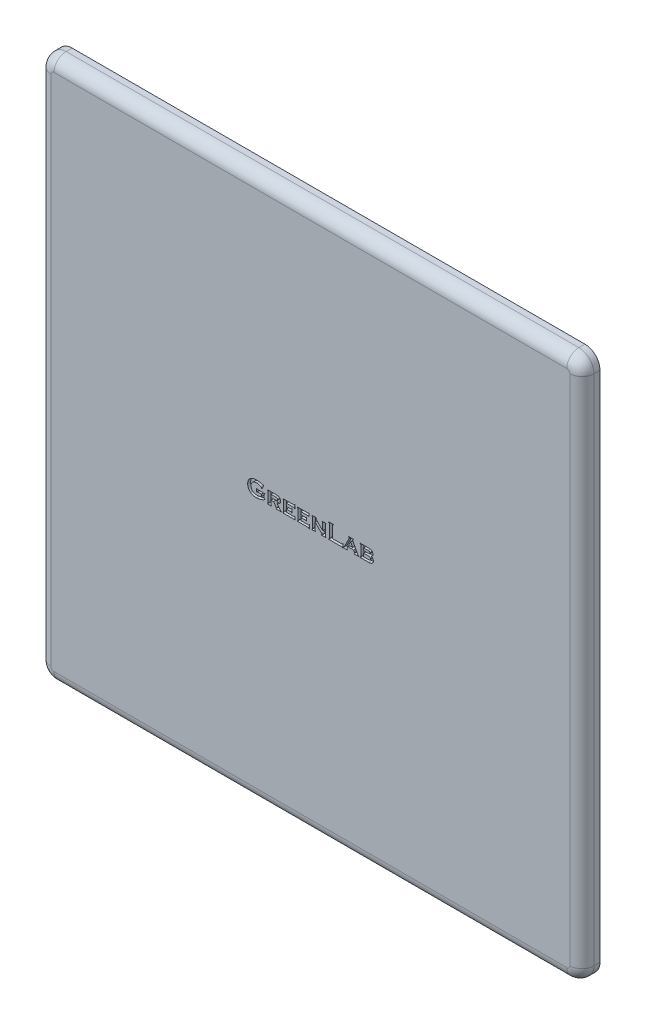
from build123d import *

# Parameters (mm, degrees)
SKETCH1_W           = 90
SKETCH1_H           = 90
BOSS_EXTRUDE1_DEPTH = 3
FILLET1_R           = 2.5
FILLET2_R           = 2
CUT_EXTRUDE1_DEPTH  = 0.5


with BuildPart() as part:
    # Sketch1 → Boss-Extrude1 (new body)
    with BuildSketch(Plane.XY.offset(3)):
        with Locations((-0.036499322, -1.389992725)):
            Rectangle(SKETCH1_W, SKETCH1_H)
    extrude(amount=-BOSS_EXTRUDE1_DEPTH)

    # Fillet1
    fillet1_edges = [part.edges().sort_by_distance(p)[0] for p in [
        (44.963500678, 43.610007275, 1.5),
        (44.963500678, -46.389992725, 1.5),
        (-45.036499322, -46.389992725, 1.5),
        (-45.036499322, 43.610007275, 1.5),
    ]]
    fillet(fillet1_edges, radius=FILLET1_R)

    # Fillet2
    fillet2_edges = [part.edges().sort_by_distance(p)[0] for p in [
        (-45.036499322, -1.389992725, 3),
        (-0.036499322, 43.610007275, 3),
        (-0.036499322, -46.389992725, 3),
        (44.963500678, -1.389992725, 3),
        (44.231267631, 42.877774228, 3),
        (44.231267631, -45.657759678, 3),
        (-44.304266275, 42.877774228, 3),
        (-44.304266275, -45.657759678, 3),
    ]]
    fillet(fillet2_edges, radius=FILLET2_R)

    # Sketch2 → Cut-Extrude1 (cut)
    # profile 1 of 8: a face of its own
    with BuildSketch(Plane.XY.offset(3)):
        with BuildLine():
            Line((-8.144138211, -1.737214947), (-8.773478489, -1.737214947))
            add(Edge.make_bspline(
                [(-8.773478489, -1.737214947), (-8.782519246, -1.737627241), (-8.799601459, -1.738406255), (-8.8238465, -1.741488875), (-8.843990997, -1.749456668), (-8.861458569, -1.759285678), (-8.875389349, -1.773931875), (-8.88796918, -1.792222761), (-8.899277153, -1.815063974), (-8.904992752, -1.832255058), (-8.9080271, -1.841381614)],
                knots=[0, 0, 0, 0, 1.161951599, 2.195469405, 3.113157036, 3.92473158, 4.744880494, 5.677977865, 6.767264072, 8, 8, 8, 8], degree=3))
            Line((-8.9080271, -1.841381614), (-8.977471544, -1.841381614))
            Line((-8.977471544, -1.841381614), (-8.977471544, -1.285826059))
            Line((-8.977471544, -1.285826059), (-8.9080271, -1.285826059))
            add(Edge.make_bspline(
                [(-8.9080271, -1.285826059), (-8.905044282, -1.295160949), (-8.899471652, -1.312600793), (-8.887670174, -1.335390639), (-8.876148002, -1.354438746), (-8.862165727, -1.368844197), (-8.84506833, -1.378330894), (-8.82537208, -1.385574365), (-8.801790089, -1.388851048), (-8.785056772, -1.389597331), (-8.776191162, -1.389992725)],
                knots=[0, 0, 0, 0, 1.267174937, 2.367390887, 3.316236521, 4.144614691, 4.932227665, 5.829021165, 6.8497767, 8, 8, 8, 8], degree=3))
            Line((-8.776191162, -1.389992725), (-7.588582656, -1.389992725))
            Line((-7.588582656, -1.389992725), (-7.588582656, -1.45943717))
            add(Edge.make_bspline(
                [(-7.588582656, -1.45943717), (-7.59754101, -1.462269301), (-7.614378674, -1.46759243), (-7.636756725, -1.478760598), (-7.655461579, -1.490214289), (-7.669798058, -1.503939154), (-7.680692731, -1.519693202), (-7.687410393, -1.538585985), (-7.691916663, -1.560317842), (-7.692458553, -1.575873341), (-7.692749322, -1.584220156)],
                knots=[0, 0, 0, 0, 1.261989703, 2.371971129, 3.357346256, 4.200586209, 5.023932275, 5.909634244, 6.878345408, 8, 8, 8, 8], degree=3))
            Line((-7.692749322, -1.584220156), (-7.692749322, -2.06382085))
            add(Edge.make_bspline(
                [(-7.692749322, -2.06382085), (-7.692389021, -2.072153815), (-7.691719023, -2.087649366), (-7.688043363, -2.109684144), (-7.681231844, -2.128574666), (-7.670937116, -2.144781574), (-7.656643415, -2.158383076), (-7.6375534, -2.16930767), (-7.614917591, -2.180464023), (-7.597724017, -2.185778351), (-7.588582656, -2.188603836)],
                knots=[0, 0, 0, 0, 1.116533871, 2.076248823, 2.980572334, 3.786808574, 4.626198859, 5.59413096, 6.720864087, 8, 8, 8, 8], degree=3))
            Line((-7.588582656, -2.188603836), (-7.588582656, -2.258048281))
            add(Edge.make_bspline(
                [(-7.588582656, -2.258048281), (-7.647165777, -2.291299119), (-7.762319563, -2.356658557), (-7.938587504, -2.441141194), (-8.113332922, -2.513076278), (-8.286717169, -2.571925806), (-8.458679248, -2.617915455), (-8.629290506, -2.650401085), (-8.798656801, -2.670905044), (-8.911226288, -2.67345022), (-8.967163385, -2.674714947)],
                knots=[0, 0, 0, 0, 1.109239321, 2.180373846, 3.216973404, 4.220153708, 5.194106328, 6.146335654, 7.078892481, 8, 8, 8, 8], degree=3))
            add(Edge.make_bspline(
                [(-8.967163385, -2.674714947), (-9.016570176, -2.673985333), (-9.113047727, -2.6725606), (-9.254211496, -2.658411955), (-9.388532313, -2.636773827), (-9.515697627, -2.60491896), (-9.636576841, -2.565743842), (-9.749879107, -2.516101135), (-9.856763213, -2.458190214), (-9.922429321, -2.412224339), (-9.955119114, -2.389341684)],
                knots=[0, 0, 0, 0, 1.133031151, 2.212490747, 3.251195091, 4.25132316, 5.216867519, 6.162529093, 7.085273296, 8, 8, 8, 8], degree=3))
            add(Edge.make_bspline(
                [(-9.955119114, -2.389341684), (-9.974623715, -2.374161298), (-10.013342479, -2.344026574), (-10.06812678, -2.295921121), (-10.118661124, -2.245018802), (-10.166049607, -2.192711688), (-10.209092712, -2.137394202), (-10.248472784, -2.080087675), (-10.284671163, -2.020933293), (-10.315923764, -1.959172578), (-10.344477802, -1.895617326), (-10.368677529, -1.829551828), (-10.389228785, -1.761381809), (-10.406973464, -1.691264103), (-10.419684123, -1.618685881), (-10.428759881, -1.543883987), (-10.435179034, -1.467144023), (-10.435595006, -1.415143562), (-10.435804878, -1.388907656)],
                knots=[0, 0, 0, 0, 1.027594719, 2.039887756, 3.02889878, 4.008719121, 4.97294883, 5.940778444, 6.898978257, 7.854104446, 8.816896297, 9.794723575, 10.777166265, 11.776613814, 12.800294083, 13.838400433, 14.909403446, 16, 16, 16, 16], degree=3))
            add(Edge.make_bspline(
                [(-10.435804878, -1.388907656), (-10.434663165, -1.340368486), (-10.432433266, -1.245565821), (-10.411811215, -1.107139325), (-10.378221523, -0.976379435), (-10.331689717, -0.852851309), (-10.270624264, -0.737522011), (-10.197173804, -0.629462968), (-10.109694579, -0.529049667), (-10.042460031, -0.47001784), (-10.008287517, -0.440014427)],
                knots=[0, 0, 0, 0, 1.080618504, 2.110574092, 3.109061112, 4.08310081, 5.043468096, 6.008781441, 6.987946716, 8, 8, 8, 8], degree=3))
            add(Edge.make_bspline(
                [(-10.008287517, -0.440014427), (-9.973768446, -0.412982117), (-9.904418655, -0.358673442), (-9.789285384, -0.291422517), (-9.666635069, -0.233476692), (-9.535458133, -0.186305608), (-9.395926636, -0.150143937), (-9.248251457, -0.124304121), (-9.092297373, -0.108324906), (-8.985467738, -0.106304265), (-8.930813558, -0.105270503)],
                knots=[0, 0, 0, 0, 0.913103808, 1.834451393, 2.772129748, 3.738097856, 4.735733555, 5.773315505, 6.860825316, 8, 8, 8, 8], degree=3))
            add(Edge.make_bspline(
                [(-8.930813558, -0.105270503), (-8.895720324, -0.105879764), (-8.82654932, -0.107080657), (-8.724365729, -0.113944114), (-8.625337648, -0.126594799), (-8.527504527, -0.144157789), (-8.428003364, -0.168094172), (-8.323395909, -0.198183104), (-8.212481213, -0.235024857), (-8.136984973, -0.263594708), (-8.09802276, -0.278339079)],
                knots=[0, 0, 0, 0, 0.983904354, 1.939338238, 2.869415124, 3.781350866, 4.72455948, 5.737149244, 6.832184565, 8, 8, 8, 8], degree=3))
            add(Edge.make_bspline(
                [(-8.09802276, -0.278339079), (-8.078921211, -0.285769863), (-8.043877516, -0.299402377), (-7.995262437, -0.315244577), (-7.955382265, -0.325505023), (-7.931503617, -0.327421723), (-7.92115644, -0.328252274)],
                knots=[0, 0, 0, 0, 1.33242011, 2.444457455, 3.325947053, 4, 4, 4, 4], degree=3))
            add(Edge.make_bspline(
                [(-7.92115644, -0.328252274), (-7.914395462, -0.327662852), (-7.899898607, -0.326399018), (-7.87818472, -0.317405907), (-7.854893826, -0.304059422), (-7.83981049, -0.292303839), (-7.831638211, -0.285934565)],
                knots=[0, 0, 0, 0, 0.80452628, 1.72506123, 2.767418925, 4, 4, 4, 4], degree=3))
            Line((-7.831638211, -0.285934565), (-7.762193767, -0.313603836))
            Line((-7.762193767, -0.313603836), (-8.057332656, -0.91256217))
            Line((-8.057332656, -0.91256217), (-8.110501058, -0.884350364))
            add(Edge.make_bspline(
                [(-8.110501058, -0.884350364), (-8.110802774, -0.874742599), (-8.111357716, -0.857071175), (-8.115526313, -0.832832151), (-8.119983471, -0.812699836), (-8.126666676, -0.795494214), (-8.137850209, -0.780525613), (-8.151749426, -0.764139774), (-8.171163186, -0.747063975), (-8.185682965, -0.735446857), (-8.193508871, -0.729185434)],
                knots=[0, 0, 0, 0, 1.244331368, 2.288680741, 3.181265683, 3.916936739, 4.658188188, 5.588746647, 6.700376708, 8, 8, 8, 8], degree=3))
            add(Edge.make_bspline(
                [(-8.193508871, -0.729185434), (-8.214203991, -0.714980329), (-8.258191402, -0.684787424), (-8.33472517, -0.646463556), (-8.42449474, -0.612615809), (-8.524113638, -0.581379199), (-8.628624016, -0.555285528), (-8.732988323, -0.536236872), (-8.834504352, -0.524251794), (-8.901305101, -0.522698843), (-8.934068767, -0.52193717)],
                knots=[0, 0, 0, 0, 0.772448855, 1.64183753, 2.627606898, 3.725128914, 4.855858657, 5.942928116, 6.991070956, 8, 8, 8, 8], degree=3))
            add(Edge.make_bspline(
                [(-8.934068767, -0.52193717), (-8.966288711, -0.522485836), (-9.02927475, -0.523558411), (-9.121811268, -0.534226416), (-9.209999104, -0.551399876), (-9.294297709, -0.575331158), (-9.374073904, -0.606156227), (-9.449643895, -0.644183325), (-9.52163994, -0.688074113), (-9.565399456, -0.723438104), (-9.587280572, -0.741121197)],
                knots=[0, 0, 0, 0, 1.098368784, 2.14717621, 3.171603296, 4.15934231, 5.131674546, 6.083189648, 7.041535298, 8, 8, 8, 8], degree=3))
            add(Edge.make_bspline(
                [(-9.587280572, -0.741121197), (-9.610785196, -0.762104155), (-9.656995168, -0.803356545), (-9.716418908, -0.873937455), (-9.767059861, -0.948834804), (-9.808821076, -1.028825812), (-9.840901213, -1.113932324), (-9.863375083, -1.204070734), (-9.878199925, -1.298899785), (-9.879557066, -1.363893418), (-9.880249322, -1.397045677)],
                knots=[0, 0, 0, 0, 1.016795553, 1.999014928, 2.971244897, 3.932867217, 4.907271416, 5.901990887, 6.92983762, 8, 8, 8, 8], degree=3))
            add(Edge.make_bspline(
                [(-9.880249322, -1.397045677), (-9.879526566, -1.429292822), (-9.878114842, -1.492279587), (-9.8637868, -1.584374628), (-9.842161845, -1.671923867), (-9.810061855, -1.754527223), (-9.770107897, -1.832500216), (-9.720282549, -1.905292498), (-9.662631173, -1.974294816), (-9.617302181, -2.014628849), (-9.594333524, -2.03506651)],
                knots=[0, 0, 0, 0, 1.069643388, 2.089281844, 3.086639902, 4.057689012, 5.02427436, 5.988321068, 6.980662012, 8, 8, 8, 8], degree=3))
            add(Edge.make_bspline(
                [(-9.594333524, -2.03506651), (-9.572064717, -2.052887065), (-9.527330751, -2.088685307), (-9.453696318, -2.134298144), (-9.374500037, -2.172090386), (-9.290715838, -2.203752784), (-9.201718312, -2.228238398), (-9.107465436, -2.245179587), (-9.008132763, -2.256588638), (-8.940069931, -2.25755488), (-8.905314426, -2.258048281)],
                knots=[0, 0, 0, 0, 0.924808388, 1.857771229, 2.80254234, 3.768129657, 4.760342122, 5.792672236, 6.872853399, 8, 8, 8, 8], degree=3))
            add(Edge.make_bspline(
                [(-8.905314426, -2.258048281), (-8.870758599, -2.257321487), (-8.801723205, -2.255869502), (-8.69839727, -2.247254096), (-8.595968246, -2.231744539), (-8.495010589, -2.211466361), (-8.397901, -2.185725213), (-8.306399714, -2.155560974), (-8.222048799, -2.120496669), (-8.16963508, -2.092953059), (-8.144138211, -2.079554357)],
                knots=[0, 0, 0, 0, 1.05048524, 2.098652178, 3.148964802, 4.19795309, 5.227341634, 6.200829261, 7.124785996, 8, 8, 8, 8], degree=3))
            Line((-8.144138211, -2.079554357), (-8.144138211, -1.737214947))
        make_face()
    # profile 2 of 8: a face of its own
    with BuildSketch(Plane.XY.offset(3)):
        with BuildLine():
            Line((-6.581638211, -1.806659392), (-6.581638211, -2.438169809))
            add(Edge.make_bspline(
                [(-6.581638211, -2.438169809), (-6.581339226, -2.446872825), (-6.580780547, -2.463135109), (-6.576346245, -2.485988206), (-6.569437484, -2.505677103), (-6.559532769, -2.522890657), (-6.544724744, -2.536970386), (-6.526446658, -2.549739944), (-6.503579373, -2.561308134), (-6.486596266, -2.567318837), (-6.477471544, -2.570548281)],
                knots=[0, 0, 0, 0, 1.132768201, 2.116668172, 3.018181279, 3.842213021, 4.674950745, 5.655178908, 6.740169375, 8, 8, 8, 8], degree=3))
            Line((-6.477471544, -2.570548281), (-6.477471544, -2.639992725))
            Line((-6.477471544, -2.639992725), (-7.171915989, -2.639992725))
            Line((-7.171915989, -2.639992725), (-7.171915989, -2.570548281))
            add(Edge.make_bspline(
                [(-7.171915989, -2.570548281), (-7.16297178, -2.56769371), (-7.146160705, -2.562328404), (-7.123652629, -2.551458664), (-7.105319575, -2.539027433), (-7.090978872, -2.524313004), (-7.080495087, -2.506813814), (-7.072915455, -2.486618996), (-7.068653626, -2.463118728), (-7.06806431, -2.446506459), (-7.067749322, -2.437627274)],
                knots=[0, 0, 0, 0, 1.214843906, 2.283358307, 3.225537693, 4.070394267, 4.922042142, 5.848661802, 6.850119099, 8, 8, 8, 8], degree=3))
            Line((-7.067749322, -2.437627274), (-7.067749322, -0.793747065))
            add(Edge.make_bspline(
                [(-7.067749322, -0.793747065), (-7.068180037, -0.785073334), (-7.069000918, -0.768542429), (-7.071879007, -0.745108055), (-7.080264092, -0.725699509), (-7.089773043, -0.708439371), (-7.104635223, -0.694599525), (-7.122542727, -0.681296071), (-7.145730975, -0.670251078), (-7.162817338, -0.664101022), (-7.171915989, -0.660826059)],
                knots=[0, 0, 0, 0, 1.128472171, 2.1507081, 3.035212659, 3.856119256, 4.685698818, 5.643135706, 6.74494729, 8, 8, 8, 8], degree=3))
            Line((-7.171915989, -0.660826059), (-7.171915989, -0.591381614))
            Line((-7.171915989, -0.591381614), (-5.84162085, -0.591381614))
            add(Edge.make_bspline(
                [(-5.84162085, -0.591381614), (-5.800927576, -0.59167351), (-5.724751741, -0.592219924), (-5.618103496, -0.596675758), (-5.527062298, -0.605329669), (-5.449154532, -0.616362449), (-5.380713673, -0.632585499), (-5.317790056, -0.653592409), (-5.258430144, -0.680220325), (-5.221837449, -0.702398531), (-5.203600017, -0.713451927)],
                knots=[0, 0, 0, 0, 1.48188809, 2.77402262, 3.885406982, 4.811191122, 5.637019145, 6.442966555, 7.223990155, 8, 8, 8, 8], degree=3))
            add(Edge.make_bspline(
                [(-5.203600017, -0.713451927), (-5.186012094, -0.725787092), (-5.151226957, -0.750183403), (-5.10641443, -0.795472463), (-5.068809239, -0.846466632), (-5.037558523, -0.902736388), (-5.013717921, -0.96488959), (-4.996390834, -1.032577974), (-4.986026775, -1.106107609), (-4.984963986, -1.157030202), (-4.984415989, -1.183286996)],
                knots=[0, 0, 0, 0, 0.949876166, 1.878651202, 2.806113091, 3.748939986, 4.72015234, 5.745812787, 6.837692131, 8, 8, 8, 8], degree=3))
            add(Edge.make_bspline(
                [(-4.984415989, -1.183286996), (-4.984814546, -1.203377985), (-4.985592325, -1.242585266), (-4.992172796, -1.299773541), (-5.003067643, -1.353432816), (-5.017406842, -1.404013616), (-5.03733505, -1.450649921), (-5.060483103, -1.494669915), (-5.088890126, -1.534657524), (-5.121332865, -1.571698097), (-5.158733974, -1.605338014), (-5.200702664, -1.637279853), (-5.248517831, -1.665485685), (-5.30121253, -1.691922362), (-5.359222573, -1.715383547), (-5.422322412, -1.737283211), (-5.490898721, -1.756130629), (-5.538653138, -1.766556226), (-5.563300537, -1.77193717)],
                knots=[0, 0, 0, 0, 1.054974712, 2.05876829, 3.018077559, 3.928757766, 4.81427522, 5.67693176, 6.535972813, 7.383915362, 8.257948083, 9.17356801, 10.149288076, 11.168732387, 12.267602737, 13.433048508, 14.67512408, 16, 16, 16, 16], degree=3))
            Line((-5.563300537, -1.77193717), (-5.166165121, -2.30741894))
            add(Edge.make_bspline(
                [(-5.166165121, -2.30741894), (-5.149198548, -2.329833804), (-5.11782083, -2.371287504), (-5.071522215, -2.426039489), (-5.031652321, -2.470205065), (-4.995313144, -2.503674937), (-4.960310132, -2.52904479), (-4.923735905, -2.547172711), (-4.885890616, -2.562652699), (-4.859035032, -2.567905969), (-4.8455271, -2.570548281)],
                knots=[0, 0, 0, 0, 1.583031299, 2.927633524, 4.037651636, 4.931799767, 5.706188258, 6.462410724, 7.226616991, 8, 8, 8, 8], degree=3))
            Line((-4.8455271, -2.570548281), (-4.8455271, -2.639992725))
            Line((-4.8455271, -2.639992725), (-5.770548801, -2.639992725))
            Line((-5.770548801, -2.639992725), (-5.770548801, -2.570548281))
            add(Edge.make_bspline(
                [(-5.770548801, -2.570548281), (-5.755764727, -2.566538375), (-5.729315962, -2.559364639), (-5.697754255, -2.540734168), (-5.674652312, -2.518840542), (-5.672362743, -2.500251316), (-5.671264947, -2.491338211)],
                knots=[0, 0, 0, 0, 1.339679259, 2.396691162, 3.231250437, 4, 4, 4, 4], degree=3))
            add(Edge.make_bspline(
                [(-5.671264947, -2.491338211), (-5.672163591, -2.483821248), (-5.674242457, -2.466431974), (-5.687946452, -2.439374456), (-5.707438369, -2.40713322), (-5.724686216, -2.385175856), (-5.734198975, -2.373065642)],
                knots=[0, 0, 0, 0, 0.664601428, 1.537447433, 2.641820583, 4, 4, 4, 4], degree=3))
            Line((-5.734198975, -2.373065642), (-6.142727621, -1.806659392))
            Line((-6.142727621, -1.806659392), (-6.581638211, -1.806659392))
        make_face()
        with BuildLine():
            Line((-6.581638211, -1.424714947), (-5.836195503, -1.424714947))
            add(Edge.make_bspline(
                [(-5.836195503, -1.424714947), (-5.809759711, -1.424463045), (-5.760396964, -1.423992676), (-5.691983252, -1.416453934), (-5.633783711, -1.407233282), (-5.60024108, -1.394632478), (-5.585001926, -1.388907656)],
                knots=[0, 0, 0, 0, 1.241949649, 2.3190547, 3.236309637, 4, 4, 4, 4], degree=3))
            add(Edge.make_bspline(
                [(-5.585001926, -1.388907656), (-5.575990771, -1.384646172), (-5.558390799, -1.376322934), (-5.534973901, -1.359674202), (-5.514097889, -1.340840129), (-5.498799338, -1.317462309), (-5.48586407, -1.292094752), (-5.476771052, -1.263732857), (-5.471219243, -1.232333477), (-5.470764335, -1.210438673), (-5.4705271, -1.199020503)],
                knots=[0, 0, 0, 0, 1.008207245, 1.969161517, 2.902631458, 3.838078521, 4.780680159, 5.783374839, 6.844026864, 8, 8, 8, 8], degree=3))
            add(Edge.make_bspline(
                [(-5.4705271, -1.199020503), (-5.471249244, -1.179364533), (-5.472599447, -1.142613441), (-5.488019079, -1.092225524), (-5.51343648, -1.050902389), (-5.544497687, -1.026014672), (-5.573435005, -1.010456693), (-5.599665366, -1.000826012), (-5.629359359, -0.992160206), (-5.663292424, -0.985201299), (-5.700989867, -0.979906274), (-5.742651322, -0.97634143), (-5.788047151, -0.973289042), (-5.819732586, -0.973313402), (-5.836195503, -0.973326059)],
                knots=[0, 0, 0, 0, 1.425592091, 2.665453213, 3.789359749, 4.900959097, 5.513024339, 6.175067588, 6.928547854, 7.761851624, 8.692003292, 9.695964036, 10.802883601, 12, 12, 12, 12], degree=3))
            Line((-5.836195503, -0.973326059), (-6.581638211, -0.973326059))
            Line((-6.581638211, -0.973326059), (-6.581638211, -1.424714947))
        make_face(mode=Mode.SUBTRACT)
    # profile 3 of 8: a face of its own
    with BuildSketch(Plane.XY.offset(3)):
        with BuildLine():
            Line((-4.012193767, -1.806659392), (-4.012193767, -2.258048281))
            Line((-4.012193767, -2.258048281), (-2.754055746, -2.258048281))
            add(Edge.make_bspline(
                [(-2.754055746, -2.258048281), (-2.745362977, -2.257680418), (-2.729152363, -2.256994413), (-2.706205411, -2.253415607), (-2.686602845, -2.24654378), (-2.669818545, -2.236122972), (-2.655200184, -2.222052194), (-2.64294848, -2.203182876), (-2.632154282, -2.180078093), (-2.626382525, -2.162992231), (-2.623304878, -2.153881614)],
                knots=[0, 0, 0, 0, 1.135380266, 2.11730133, 3.020893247, 3.826673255, 4.678188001, 5.647254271, 6.745456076, 8, 8, 8, 8], degree=3))
            Line((-2.623304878, -2.153881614), (-2.553860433, -2.153881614))
            Line((-2.553860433, -2.153881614), (-2.553860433, -2.744159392))
            Line((-2.553860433, -2.744159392), (-2.623304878, -2.744159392))
            add(Edge.make_bspline(
                [(-2.623304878, -2.744159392), (-2.625934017, -2.735199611), (-2.630889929, -2.71831048), (-2.641882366, -2.695912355), (-2.654262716, -2.677537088), (-2.668936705, -2.663409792), (-2.686032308, -2.652577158), (-2.706169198, -2.645190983), (-2.729464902, -2.64092119), (-2.74589859, -2.640314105), (-2.754598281, -2.639992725)],
                knots=[0, 0, 0, 0, 1.215074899, 2.290408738, 3.23860127, 4.08884986, 4.925925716, 5.858459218, 6.866307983, 8, 8, 8, 8], degree=3))
            Line((-2.754598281, -2.639992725), (-4.602471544, -2.639992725))
            Line((-4.602471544, -2.639992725), (-4.602471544, -2.570548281))
            add(Edge.make_bspline(
                [(-4.602471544, -2.570548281), (-4.593527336, -2.56769371), (-4.576716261, -2.562328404), (-4.554208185, -2.551458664), (-4.53587513, -2.539027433), (-4.521534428, -2.524313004), (-4.511050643, -2.506813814), (-4.50347101, -2.486618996), (-4.499209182, -2.463118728), (-4.498619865, -2.446506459), (-4.498304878, -2.437627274)],
                knots=[0, 0, 0, 0, 1.214843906, 2.283358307, 3.225537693, 4.070394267, 4.922042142, 5.848661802, 6.850119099, 8, 8, 8, 8], degree=3))
            Line((-4.498304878, -2.437627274), (-4.498304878, -0.793747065))
            add(Edge.make_bspline(
                [(-4.498304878, -0.793747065), (-4.498735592, -0.785073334), (-4.499556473, -0.768542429), (-4.502434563, -0.745108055), (-4.510819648, -0.725699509), (-4.520328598, -0.708439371), (-4.535190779, -0.694599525), (-4.553098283, -0.681296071), (-4.57628653, -0.670251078), (-4.593372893, -0.664101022), (-4.602471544, -0.660826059)],
                knots=[0, 0, 0, 0, 1.128472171, 2.1507081, 3.035212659, 3.856119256, 4.685698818, 5.643135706, 6.74494729, 8, 8, 8, 8], degree=3))
            Line((-4.602471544, -0.660826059), (-4.602471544, -0.591381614))
            Line((-4.602471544, -0.591381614), (-2.82458526, -0.591381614))
            add(Edge.make_bspline(
                [(-2.82458526, -0.591381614), (-2.8157025, -0.591076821), (-2.799083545, -0.590506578), (-2.775856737, -0.586161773), (-2.755957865, -0.57921028), (-2.738789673, -0.569092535), (-2.724097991, -0.554828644), (-2.712020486, -0.536080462), (-2.70082796, -0.513391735), (-2.695570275, -0.496355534), (-2.692749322, -0.487214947)],
                knots=[0, 0, 0, 0, 1.152879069, 2.156947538, 3.05581166, 3.877422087, 4.724481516, 5.688477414, 6.75977783, 8, 8, 8, 8], degree=3))
            Line((-2.692749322, -0.487214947), (-2.623304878, -0.487214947))
            Line((-2.623304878, -0.487214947), (-2.623304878, -1.077492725))
            Line((-2.623304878, -1.077492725), (-2.692749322, -1.077492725))
            add(Edge.make_bspline(
                [(-2.692749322, -1.077492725), (-2.695614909, -1.068376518), (-2.701004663, -1.051230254), (-2.711690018, -1.028243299), (-2.724298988, -1.00985038), (-2.73874536, -0.995534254), (-2.755959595, -0.985806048), (-2.775415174, -0.977466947), (-2.798834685, -0.974574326), (-2.815367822, -0.973755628), (-2.824042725, -0.973326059)],
                knots=[0, 0, 0, 0, 1.242738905, 2.33741155, 3.283964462, 4.132742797, 4.956020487, 5.843079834, 6.86826837, 8, 8, 8, 8], degree=3))
            Line((-2.824042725, -0.973326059), (-4.012193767, -0.973326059))
            Line((-4.012193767, -0.973326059), (-4.012193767, -1.424714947))
            Line((-4.012193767, -1.424714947), (-3.274889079, -1.424714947))
            add(Edge.make_bspline(
                [(-3.274889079, -1.424714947), (-3.266367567, -1.424401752), (-3.25028759, -1.423810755), (-3.22778269, -1.419492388), (-3.208382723, -1.412570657), (-3.191743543, -1.402244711), (-3.177080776, -1.388195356), (-3.16508643, -1.369287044), (-3.153320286, -1.346701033), (-3.147347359, -1.329688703), (-3.144138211, -1.320548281)],
                knots=[0, 0, 0, 0, 1.117968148, 2.109590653, 2.995889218, 3.806125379, 4.662349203, 5.636774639, 6.730281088, 8, 8, 8, 8], degree=3))
            Line((-3.144138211, -1.320548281), (-3.074693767, -1.320548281))
            Line((-3.074693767, -1.320548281), (-3.074693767, -1.910826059))
            Line((-3.074693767, -1.910826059), (-3.144138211, -1.910826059))
            add(Edge.make_bspline(
                [(-3.144138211, -1.910826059), (-3.146983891, -1.901876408), (-3.152332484, -1.885055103), (-3.163377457, -1.862479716), (-3.17549579, -1.843930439), (-3.189802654, -1.829387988), (-3.206523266, -1.818887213), (-3.226482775, -1.811720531), (-3.249585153, -1.807635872), (-3.266191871, -1.806995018), (-3.274889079, -1.806659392)],
                knots=[0, 0, 0, 0, 1.225527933, 2.303439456, 3.273384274, 4.108798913, 4.947881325, 5.830104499, 6.863590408, 8, 8, 8, 8], degree=3))
            Line((-3.274889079, -1.806659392), (-4.012193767, -1.806659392))
        make_face()
    # profile 4 of 8: a face of its own
    with BuildSketch(Plane.XY.offset(3)):
        with BuildLine():
            Line((-1.616360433, -1.806659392), (-1.616360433, -2.258048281))
            Line((-1.616360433, -2.258048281), (-0.358222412, -2.258048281))
            add(Edge.make_bspline(
                [(-0.358222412, -2.258048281), (-0.349529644, -2.257680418), (-0.33331903, -2.256994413), (-0.310372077, -2.253415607), (-0.290769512, -2.24654378), (-0.273985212, -2.236122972), (-0.259366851, -2.222052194), (-0.247115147, -2.203182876), (-0.236320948, -2.180078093), (-0.230549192, -2.162992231), (-0.227471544, -2.153881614)],
                knots=[0, 0, 0, 0, 1.135380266, 2.11730133, 3.020893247, 3.826673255, 4.678188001, 5.647254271, 6.745456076, 8, 8, 8, 8], degree=3))
            Line((-0.227471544, -2.153881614), (-0.1580271, -2.153881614))
            Line((-0.1580271, -2.153881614), (-0.1580271, -2.744159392))
            Line((-0.1580271, -2.744159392), (-0.227471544, -2.744159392))
            add(Edge.make_bspline(
                [(-0.227471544, -2.744159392), (-0.230100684, -2.735199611), (-0.235056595, -2.71831048), (-0.246049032, -2.695912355), (-0.258429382, -2.677537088), (-0.273103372, -2.663409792), (-0.290198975, -2.652577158), (-0.310335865, -2.645190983), (-0.333631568, -2.64092119), (-0.350065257, -2.640314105), (-0.358764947, -2.639992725)],
                knots=[0, 0, 0, 0, 1.215074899, 2.290408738, 3.23860127, 4.08884986, 4.925925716, 5.858459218, 6.866307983, 8, 8, 8, 8], degree=3))
            Line((-0.358764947, -2.639992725), (-2.206638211, -2.639992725))
            Line((-2.206638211, -2.639992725), (-2.206638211, -2.570548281))
            add(Edge.make_bspline(
                [(-2.206638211, -2.570548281), (-2.197694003, -2.56769371), (-2.180882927, -2.562328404), (-2.158374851, -2.551458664), (-2.140041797, -2.539027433), (-2.125701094, -2.524313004), (-2.115217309, -2.506813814), (-2.107637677, -2.486618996), (-2.103375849, -2.463118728), (-2.102786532, -2.446506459), (-2.102471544, -2.437627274)],
                knots=[0, 0, 0, 0, 1.214843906, 2.283358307, 3.225537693, 4.070394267, 4.922042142, 5.848661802, 6.850119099, 8, 8, 8, 8], degree=3))
            Line((-2.102471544, -2.437627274), (-2.102471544, -0.793747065))
            add(Edge.make_bspline(
                [(-2.102471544, -0.793747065), (-2.102902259, -0.785073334), (-2.10372314, -0.768542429), (-2.106601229, -0.745108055), (-2.114986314, -0.725699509), (-2.124495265, -0.708439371), (-2.139357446, -0.694599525), (-2.157264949, -0.681296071), (-2.180453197, -0.670251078), (-2.19753956, -0.664101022), (-2.206638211, -0.660826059)],
                knots=[0, 0, 0, 0, 1.128472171, 2.1507081, 3.035212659, 3.856119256, 4.685698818, 5.643135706, 6.74494729, 8, 8, 8, 8], degree=3))
            Line((-2.206638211, -0.660826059), (-2.206638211, -0.591381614))
            Line((-2.206638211, -0.591381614), (-0.428751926, -0.591381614))
            add(Edge.make_bspline(
                [(-0.428751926, -0.591381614), (-0.419869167, -0.591076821), (-0.403250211, -0.590506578), (-0.380023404, -0.586161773), (-0.360124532, -0.57921028), (-0.34295634, -0.569092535), (-0.328264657, -0.554828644), (-0.316187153, -0.536080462), (-0.304994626, -0.513391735), (-0.299736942, -0.496355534), (-0.296915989, -0.487214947)],
                knots=[0, 0, 0, 0, 1.152879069, 2.156947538, 3.05581166, 3.877422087, 4.724481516, 5.688477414, 6.75977783, 8, 8, 8, 8], degree=3))
            Line((-0.296915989, -0.487214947), (-0.227471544, -0.487214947))
            Line((-0.227471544, -0.487214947), (-0.227471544, -1.077492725))
            Line((-0.227471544, -1.077492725), (-0.296915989, -1.077492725))
            add(Edge.make_bspline(
                [(-0.296915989, -1.077492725), (-0.299781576, -1.068376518), (-0.30517133, -1.051230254), (-0.315856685, -1.028243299), (-0.328465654, -1.00985038), (-0.342912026, -0.995534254), (-0.360126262, -0.985806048), (-0.37958184, -0.977466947), (-0.403001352, -0.974574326), (-0.419534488, -0.973755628), (-0.428209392, -0.973326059)],
                knots=[0, 0, 0, 0, 1.242738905, 2.33741155, 3.283964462, 4.132742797, 4.956020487, 5.843079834, 6.86826837, 8, 8, 8, 8], degree=3))
            Line((-0.428209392, -0.973326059), (-1.616360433, -0.973326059))
            Line((-1.616360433, -0.973326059), (-1.616360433, -1.424714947))
            Line((-1.616360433, -1.424714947), (-0.879055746, -1.424714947))
            add(Edge.make_bspline(
                [(-0.879055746, -1.424714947), (-0.870534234, -1.424401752), (-0.854454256, -1.423810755), (-0.831949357, -1.419492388), (-0.812549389, -1.412570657), (-0.795910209, -1.402244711), (-0.781247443, -1.388195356), (-0.769253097, -1.369287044), (-0.757486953, -1.346701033), (-0.751514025, -1.329688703), (-0.748304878, -1.320548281)],
                knots=[0, 0, 0, 0, 1.117968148, 2.109590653, 2.995889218, 3.806125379, 4.662349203, 5.636774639, 6.730281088, 8, 8, 8, 8], degree=3))
            Line((-0.748304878, -1.320548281), (-0.678860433, -1.320548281))
            Line((-0.678860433, -1.320548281), (-0.678860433, -1.910826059))
            Line((-0.678860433, -1.910826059), (-0.748304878, -1.910826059))
            add(Edge.make_bspline(
                [(-0.748304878, -1.910826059), (-0.751150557, -1.901876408), (-0.756499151, -1.885055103), (-0.767544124, -1.862479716), (-0.779662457, -1.843930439), (-0.79396932, -1.829387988), (-0.810689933, -1.818887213), (-0.830649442, -1.811720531), (-0.85375182, -1.807635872), (-0.870358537, -1.806995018), (-0.879055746, -1.806659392)],
                knots=[0, 0, 0, 0, 1.225527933, 2.303439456, 3.273384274, 4.108798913, 4.947881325, 5.830104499, 6.863590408, 8, 8, 8, 8], degree=3))
            Line((-0.879055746, -1.806659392), (-1.616360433, -1.806659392))
        make_face()
    # profile 5 of 8: a face of its own
    with BuildSketch(Plane.XY.offset(3)):
        with BuildLine():
            Line((0.744750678, -1.296134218), (0.744750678, -2.43599967))
            add(Edge.make_bspline(
                [(0.744750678, -2.43599967), (0.745045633, -2.444886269), (0.745597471, -2.461512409), (0.750094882, -2.484860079), (0.756820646, -2.505303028), (0.767627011, -2.522875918), (0.782098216, -2.537811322), (0.800779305, -2.550312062), (0.823095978, -2.561841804), (0.839959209, -2.567527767), (0.848917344, -2.570548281)],
                knots=[0, 0, 0, 0, 1.143670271, 2.139718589, 3.053348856, 3.900396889, 4.773630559, 5.710721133, 6.783882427, 8, 8, 8, 8], degree=3))
            Line((0.848917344, -2.570548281), (0.848917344, -2.639992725))
            Line((0.848917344, -2.639992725), (0.189195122, -2.639992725))
            Line((0.189195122, -2.639992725), (0.189195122, -2.570548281))
            add(Edge.make_bspline(
                [(0.189195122, -2.570548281), (0.198139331, -2.56769371), (0.214950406, -2.562328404), (0.237458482, -2.551458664), (0.255791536, -2.539027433), (0.270132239, -2.524313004), (0.280616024, -2.506813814), (0.288195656, -2.486618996), (0.292457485, -2.463118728), (0.293046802, -2.446506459), (0.293361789, -2.437627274)],
                knots=[0, 0, 0, 0, 1.214843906, 2.283358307, 3.225537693, 4.070394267, 4.922042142, 5.848661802, 6.850119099, 8, 8, 8, 8], degree=3))
            Line((0.293361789, -2.437627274), (0.293361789, -0.793747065))
            add(Edge.make_bspline(
                [(0.293361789, -0.793747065), (0.292931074, -0.785073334), (0.292110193, -0.768542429), (0.289232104, -0.745108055), (0.280847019, -0.725699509), (0.271338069, -0.708439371), (0.256475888, -0.694599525), (0.238568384, -0.681296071), (0.215380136, -0.670251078), (0.198293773, -0.664101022), (0.189195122, -0.660826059)],
                knots=[0, 0, 0, 0, 1.128472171, 2.1507081, 3.035212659, 3.856119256, 4.685698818, 5.643135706, 6.74494729, 8, 8, 8, 8], degree=3))
            Line((0.189195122, -0.660826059), (0.189195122, -0.591381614))
            Line((0.189195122, -0.591381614), (0.960136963, -0.591381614))
            Line((0.960136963, -0.591381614), (0.960136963, -0.660826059))
            add(Edge.make_bspline(
                [(0.960136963, -0.660826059), (0.948345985, -0.664283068), (0.927320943, -0.670447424), (0.90120084, -0.685797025), (0.883619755, -0.70632684), (0.881813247, -0.722753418), (0.880926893, -0.730813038)],
                knots=[0, 0, 0, 0, 1.287745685, 2.296239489, 3.164058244, 4, 4, 4, 4], degree=3))
            add(Edge.make_bspline(
                [(0.880926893, -0.730813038), (0.881815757, -0.738328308), (0.883756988, -0.75474127), (0.895797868, -0.779315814), (0.913968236, -0.80554047), (0.929844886, -0.822179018), (0.938435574, -0.831181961)],
                knots=[0, 0, 0, 0, 0.763994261, 1.668524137, 2.738463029, 4, 4, 4, 4], degree=3))
            Line((0.938435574, -0.831181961), (1.994750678, -1.901060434))
            Line((1.994750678, -1.901060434), (1.994750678, -0.793747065))
            add(Edge.make_bspline(
                [(1.994750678, -0.793747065), (1.994330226, -0.785068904), (1.993528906, -0.768529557), (1.990498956, -0.744983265), (1.982401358, -0.725256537), (1.972549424, -0.7078824), (1.958069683, -0.693507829), (1.94004269, -0.680180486), (1.916719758, -0.669758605), (1.899673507, -0.663932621), (1.890584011, -0.660826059)],
                knots=[0, 0, 0, 0, 1.125637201, 2.145305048, 3.049360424, 3.868204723, 4.712412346, 5.667443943, 6.756221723, 8, 8, 8, 8], degree=3))
            Line((1.890584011, -0.660826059), (1.890584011, -0.591381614))
            Line((1.890584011, -0.591381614), (2.550306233, -0.591381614))
            Line((2.550306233, -0.591381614), (2.550306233, -0.660826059))
            add(Edge.make_bspline(
                [(2.550306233, -0.660826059), (2.541192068, -0.663887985), (2.524254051, -0.669578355), (2.501237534, -0.680513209), (2.482849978, -0.693310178), (2.468406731, -0.707920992), (2.458322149, -0.725129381), (2.451275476, -0.745180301), (2.447102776, -0.768440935), (2.446470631, -0.785049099), (2.446139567, -0.793747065)],
                knots=[0, 0, 0, 0, 1.244751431, 2.313280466, 3.288100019, 4.132968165, 4.952453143, 5.848991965, 6.873482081, 8, 8, 8, 8], degree=3))
            Line((2.446139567, -0.793747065), (2.446139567, -2.43599967))
            add(Edge.make_bspline(
                [(2.446139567, -2.43599967), (2.446473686, -2.444696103), (2.447111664, -2.46130134), (2.451245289, -2.484581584), (2.458469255, -2.504717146), (2.468246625, -2.522257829), (2.48269019, -2.537064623), (2.501694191, -2.548977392), (2.523989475, -2.561505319), (2.541136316, -2.567397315), (2.550306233, -2.570548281)],
                knots=[0, 0, 0, 0, 1.1214246, 2.141282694, 3.033768, 3.869628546, 4.710676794, 5.667831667, 6.752785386, 8, 8, 8, 8], degree=3))
            Line((2.550306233, -2.570548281), (2.550306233, -2.639992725))
            Line((2.550306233, -2.639992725), (1.831990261, -2.639992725))
            Line((1.831990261, -2.639992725), (1.831990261, -2.570548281))
            add(Edge.make_bspline(
                [(1.831990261, -2.570548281), (1.843541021, -2.567581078), (1.864367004, -2.562231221), (1.890715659, -2.54867794), (1.907968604, -2.528609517), (1.909764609, -2.512775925), (1.910657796, -2.504901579)],
                knots=[0, 0, 0, 0, 1.28387963, 2.314830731, 3.161933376, 4, 4, 4, 4], degree=3))
            add(Edge.make_bspline(
                [(1.910657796, -2.504901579), (1.909478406, -2.496169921), (1.906909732, -2.477152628), (1.890935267, -2.455360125), (1.872912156, -2.434063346), (1.851736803, -2.411001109), (1.823871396, -2.381386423), (1.802576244, -2.359986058), (1.790757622, -2.348109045)],
                knots=[0, 0, 0, 0, 0.779058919, 1.696767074, 2.352735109, 3.293916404, 4.498147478, 6, 6, 6, 6], degree=3))
            Line((1.790757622, -2.348109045), (0.744750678, -1.296134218))
        make_face()
    # profile 6 of 8: a face of its own
    with BuildSketch(Plane.XY.offset(3)):
        with BuildLine():
            Line((3.661417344, -2.223326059), (5.162610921, -2.223326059))
            add(Edge.make_bspline(
                [(5.162610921, -2.223326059), (5.171307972, -2.223001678), (5.187736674, -2.222388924), (5.210667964, -2.218229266), (5.230254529, -2.210989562), (5.247314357, -2.201218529), (5.261428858, -2.18654983), (5.273606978, -2.168069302), (5.284644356, -2.145231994), (5.290312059, -2.128280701), (5.293361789, -2.119159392)],
                knots=[0, 0, 0, 0, 1.13718709, 2.148142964, 3.030969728, 3.85821599, 4.694202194, 5.66481062, 6.743459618, 8, 8, 8, 8], degree=3))
            Line((5.293361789, -2.119159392), (5.362806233, -2.119159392))
            Line((5.362806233, -2.119159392), (5.362806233, -2.744159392))
            Line((5.362806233, -2.744159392), (5.293361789, -2.744159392))
            add(Edge.make_bspline(
                [(5.293361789, -2.744159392), (5.290267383, -2.735062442), (5.284464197, -2.718002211), (5.273937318, -2.694866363), (5.261234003, -2.676732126), (5.247353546, -2.662033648), (5.230122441, -2.652502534), (5.210705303, -2.644124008), (5.187273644, -2.641243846), (5.170742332, -2.640423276), (5.162068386, -2.639992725)],
                knots=[0, 0, 0, 0, 1.251925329, 2.347834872, 3.295457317, 4.12837309, 4.952581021, 5.840642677, 6.866989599, 8, 8, 8, 8], degree=3))
            Line((5.162068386, -2.639992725), (3.001695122, -2.639992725))
            Line((3.001695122, -2.639992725), (3.001695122, -2.570548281))
            add(Edge.make_bspline(
                [(3.001695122, -2.570548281), (3.010792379, -2.567453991), (3.027853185, -2.561651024), (3.050985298, -2.551122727), (3.069131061, -2.538423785), (3.083792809, -2.524529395), (3.093626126, -2.507053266), (3.101424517, -2.487241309), (3.104741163, -2.463586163), (3.105470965, -2.44703389), (3.105861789, -2.438169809)],
                knots=[0, 0, 0, 0, 1.245049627, 2.334940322, 3.277358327, 4.105699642, 4.925380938, 5.852235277, 6.849827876, 8, 8, 8, 8], degree=3))
            Line((3.105861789, -2.438169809), (3.105861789, -0.341815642))
            add(Edge.make_bspline(
                [(3.105861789, -0.341815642), (3.105462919, -0.332953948), (3.104718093, -0.316406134), (3.101523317, -0.292890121), (3.093522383, -0.273316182), (3.083638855, -0.255980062), (3.06934018, -0.241533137), (3.050951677, -0.228896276), (3.027863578, -0.218324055), (3.010795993, -0.212527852), (3.001695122, -0.20943717)],
                knots=[0, 0, 0, 0, 1.150912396, 2.149147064, 3.054708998, 3.874917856, 4.720532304, 5.663556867, 6.754149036, 8, 8, 8, 8], degree=3))
            Line((3.001695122, -0.20943717), (3.001695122, -0.139992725))
            Line((3.001695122, -0.139992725), (3.765584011, -0.139992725))
            Line((3.765584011, -0.139992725), (3.765584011, -0.20943717))
            add(Edge.make_bspline(
                [(3.765584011, -0.20943717), (3.756484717, -0.21233633), (3.739599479, -0.2177162), (3.716383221, -0.227959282), (3.698165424, -0.240876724), (3.683493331, -0.255507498), (3.67375584, -0.273112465), (3.666520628, -0.293229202), (3.662356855, -0.316693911), (3.661742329, -0.333480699), (3.661417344, -0.342358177)],
                knots=[0, 0, 0, 0, 1.233044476, 2.288117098, 3.259808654, 4.10196579, 4.938928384, 5.832590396, 6.853793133, 8, 8, 8, 8], degree=3))
            Line((3.661417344, -0.342358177), (3.661417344, -2.223326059))
        make_face()
    # profile 7 of 8: a face of its own
    with BuildSketch(Plane.XY.offset(3)):
        with BuildLine():
            Line((7.103257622, -2.119159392), (6.153279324, -2.119159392))
            Line((6.153279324, -2.119159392), (6.039889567, -2.337800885))
            add(Edge.make_bspline(
                [(6.039889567, -2.337800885), (6.034078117, -2.350197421), (6.023356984, -2.373066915), (6.011283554, -2.406247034), (6.002801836, -2.43503191), (6.001812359, -2.453316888), (6.001369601, -2.461498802)],
                knots=[0, 0, 0, 0, 1.258043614, 2.320875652, 3.2486483, 4, 4, 4, 4], degree=3))
            add(Edge.make_bspline(
                [(6.001369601, -2.461498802), (6.001851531, -2.4684012), (6.002780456, -2.481705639), (6.008120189, -2.500832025), (6.018401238, -2.5177084), (6.032895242, -2.532098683), (6.050371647, -2.545725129), (6.072704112, -2.555497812), (6.098270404, -2.564317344), (6.116872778, -2.568395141), (6.126695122, -2.570548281)],
                knots=[0, 0, 0, 0, 0.910861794, 1.755694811, 2.589696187, 3.483236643, 4.43677035, 5.49240796, 6.675952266, 8, 8, 8, 8], degree=3))
            Line((6.126695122, -2.570548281), (6.126695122, -2.639992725))
            Line((6.126695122, -2.639992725), (5.397528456, -2.639992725))
            Line((5.397528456, -2.639992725), (5.397528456, -2.570548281))
            add(Edge.make_bspline(
                [(5.397528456, -2.570548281), (5.408434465, -2.568627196), (5.42926109, -2.564958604), (5.457764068, -2.555946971), (5.481978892, -2.544368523), (5.502812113, -2.529551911), (5.521479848, -2.508862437), (5.540732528, -2.482222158), (5.561344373, -2.448167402), (5.574725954, -2.422698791), (5.581990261, -2.408872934)],
                knots=[0, 0, 0, 0, 1.026027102, 1.959349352, 2.761782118, 3.5064187, 4.313045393, 5.332612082, 6.551985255, 8, 8, 8, 8], degree=3))
            Line((5.581990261, -2.408872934), (6.336113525, -0.922870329))
            add(Edge.make_bspline(
                [(6.336113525, -0.922870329), (6.342470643, -0.909399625), (6.354566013, -0.883769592), (6.368632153, -0.845663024), (6.376437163, -0.809797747), (6.377792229, -0.786724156), (6.378431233, -0.77584342)],
                knots=[0, 0, 0, 0, 1.158371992, 2.203976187, 3.153055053, 4, 4, 4, 4], degree=3))
            add(Edge.make_bspline(
                [(6.378431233, -0.77584342), (6.377139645, -0.76400087), (6.374521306, -0.739993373), (6.353178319, -0.707149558), (6.318851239, -0.680565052), (6.290706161, -0.667794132), (6.275349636, -0.660826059)],
                knots=[0, 0, 0, 0, 0.861054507, 1.745550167, 2.769926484, 4, 4, 4, 4], degree=3))
            Line((6.275349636, -0.660826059), (6.275349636, -0.591381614))
            Line((6.275349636, -0.591381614), (7.072875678, -0.591381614))
            Line((7.072875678, -0.591381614), (7.072875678, -0.660826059))
            add(Edge.make_bspline(
                [(7.072875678, -0.660826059), (7.057747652, -0.667445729), (7.029639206, -0.679745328), (6.996849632, -0.708839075), (6.975524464, -0.743831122), (6.973160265, -0.76977261), (6.971964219, -0.782896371)],
                knots=[0, 0, 0, 0, 1.167592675, 2.169431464, 3.073918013, 4, 4, 4, 4], degree=3))
            add(Edge.make_bspline(
                [(6.971964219, -0.782896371), (6.972491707, -0.793443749), (6.97360816, -0.815767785), (6.98357978, -0.850525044), (6.997192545, -0.888930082), (7.010508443, -0.914695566), (7.017537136, -0.928295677)],
                knots=[0, 0, 0, 0, 0.821800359, 1.739380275, 2.806749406, 4, 4, 4, 4], degree=3))
            Line((7.017537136, -0.928295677), (7.790106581, -2.369267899))
            add(Edge.make_bspline(
                [(7.790106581, -2.369267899), (7.800134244, -2.387225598), (7.818432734, -2.419994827), (7.844588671, -2.463686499), (7.868037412, -2.496662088), (7.888818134, -2.521414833), (7.911208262, -2.539345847), (7.937497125, -2.551717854), (7.967474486, -2.563864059), (7.989823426, -2.568229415), (8.001695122, -2.570548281)],
                knots=[0, 0, 0, 0, 1.613020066, 2.94344076, 3.990283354, 4.784068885, 5.470665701, 6.219068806, 7.053974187, 8, 8, 8, 8], degree=3))
            Line((8.001695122, -2.570548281), (8.001695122, -2.639992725))
            Line((8.001695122, -2.639992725), (7.151000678, -2.639992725))
            Line((7.151000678, -2.639992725), (7.151000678, -2.570548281))
            add(Edge.make_bspline(
                [(7.151000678, -2.570548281), (7.160278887, -2.56878244), (7.177824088, -2.565443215), (7.201925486, -2.557288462), (7.222403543, -2.547087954), (7.239048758, -2.534299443), (7.252647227, -2.519494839), (7.261721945, -2.501849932), (7.26750422, -2.482295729), (7.267954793, -2.46859528), (7.268188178, -2.461498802)],
                knots=[0, 0, 0, 0, 1.280586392, 2.42160363, 3.442514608, 4.370371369, 5.257057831, 6.146457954, 7.039913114, 8, 8, 8, 8], degree=3))
            add(Edge.make_bspline(
                [(7.268188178, -2.461498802), (7.267630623, -2.451678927), (7.266434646, -2.430614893), (7.256739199, -2.397684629), (7.242178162, -2.361547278), (7.229023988, -2.33713701), (7.222072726, -2.324237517)],
                knots=[0, 0, 0, 0, 0.804870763, 1.726480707, 2.798569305, 4, 4, 4, 4], degree=3))
            Line((7.222072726, -2.324237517), (7.103257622, -2.119159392))
        make_face()
        Polygon((6.957858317, -1.841381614), (6.61931665, -1.18599967), (6.292710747, -1.841381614), align=None, mode=Mode.SUBTRACT)
    # profile 8 of 8: a face of its own
    with BuildSketch(Plane.XY.offset(3)):
        with BuildLine():
            add(Edge.make_bspline(
                [(10.0372854, -1.539732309), (10.061144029, -1.550981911), (10.106111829, -1.572184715), (10.167028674, -1.606976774), (10.218363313, -1.641269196), (10.24694331, -1.666744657), (10.260267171, -1.678621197)],
                knots=[0, 0, 0, 0, 1.199284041, 2.260363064, 3.188989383, 4, 4, 4, 4], degree=3))
            add(Edge.make_bspline(
                [(10.260267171, -1.678621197), (10.271185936, -1.689790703), (10.293034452, -1.712140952), (10.321238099, -1.749585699), (10.344497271, -1.790275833), (10.364429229, -1.833099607), (10.378832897, -1.879347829), (10.389736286, -1.928131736), (10.39634435, -1.979910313), (10.397127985, -2.015335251), (10.397528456, -2.033438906)],
                knots=[0, 0, 0, 0, 0.957204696, 1.915372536, 2.864513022, 3.827290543, 4.805779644, 5.828215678, 6.89012558, 8, 8, 8, 8], degree=3))
            add(Edge.make_bspline(
                [(10.397528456, -2.033438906), (10.396986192, -2.057713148), (10.395928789, -2.105047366), (10.385264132, -2.173993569), (10.368276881, -2.238788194), (10.343295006, -2.299033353), (10.312648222, -2.355401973), (10.273826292, -2.406783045), (10.228837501, -2.454583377), (10.193923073, -2.481828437), (10.176174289, -2.495678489)],
                knots=[0, 0, 0, 0, 1.09149512, 2.128390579, 3.131133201, 4.098244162, 5.056171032, 6.009871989, 6.988316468, 8, 8, 8, 8], degree=3))
            add(Edge.make_bspline(
                [(10.176174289, -2.495678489), (10.159221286, -2.507266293), (10.124756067, -2.530824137), (10.067899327, -2.559651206), (10.007066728, -2.584930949), (9.941307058, -2.604577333), (9.871343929, -2.621413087), (9.796249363, -2.631370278), (9.716806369, -2.639070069), (9.662234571, -2.639679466), (9.634182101, -2.639992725)],
                knots=[0, 0, 0, 0, 0.863665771, 1.755820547, 2.677628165, 3.63366667, 4.641991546, 5.703604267, 6.819544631, 8, 8, 8, 8], degree=3))
            Line((9.634182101, -2.639992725), (8.210028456, -2.639992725))
            Line((8.210028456, -2.639992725), (8.210028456, -2.570548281))
            add(Edge.make_bspline(
                [(8.210028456, -2.570548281), (8.218972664, -2.56769371), (8.235783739, -2.562328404), (8.258291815, -2.551458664), (8.27662487, -2.539027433), (8.290965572, -2.524313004), (8.301449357, -2.506813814), (8.30902899, -2.486618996), (8.313290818, -2.463118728), (8.313880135, -2.446506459), (8.314195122, -2.437627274)],
                knots=[0, 0, 0, 0, 1.214843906, 2.283358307, 3.225537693, 4.070394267, 4.922042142, 5.848661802, 6.850119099, 8, 8, 8, 8], degree=3))
            Line((8.314195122, -2.437627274), (8.314195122, -0.793747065))
            add(Edge.make_bspline(
                [(8.314195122, -0.793747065), (8.313764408, -0.785073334), (8.312943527, -0.768542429), (8.310065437, -0.745108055), (8.301680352, -0.725699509), (8.292171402, -0.708439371), (8.277309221, -0.694599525), (8.259401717, -0.681296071), (8.23621347, -0.670251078), (8.219127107, -0.664101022), (8.210028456, -0.660826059)],
                knots=[0, 0, 0, 0, 1.128472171, 2.1507081, 3.035212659, 3.856119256, 4.685698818, 5.643135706, 6.74494729, 8, 8, 8, 8], degree=3))
            Line((8.210028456, -0.660826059), (8.210028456, -0.591381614))
            Line((8.210028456, -0.591381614), (9.6075979, -0.591381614))
            add(Edge.make_bspline(
                [(9.6075979, -0.591381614), (9.637270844, -0.591750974), (9.694522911, -0.59246363), (9.777276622, -0.599227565), (9.853970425, -0.609239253), (9.924694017, -0.623488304), (9.989025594, -0.643218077), (10.047284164, -0.666564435), (10.100351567, -0.693180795), (10.131239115, -0.715907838), (10.146334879, -0.727015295)],
                knots=[0, 0, 0, 0, 1.259531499, 2.430186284, 3.522538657, 4.541950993, 5.489154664, 6.374533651, 7.205580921, 8, 8, 8, 8], degree=3))
            add(Edge.make_bspline(
                [(10.146334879, -0.727015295), (10.160937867, -0.739152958), (10.189635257, -0.763005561), (10.226697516, -0.804162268), (10.257907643, -0.848498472), (10.283511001, -0.896050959), (10.30396852, -0.946916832), (10.317599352, -1.001337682), (10.326826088, -1.058913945), (10.327657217, -1.098432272), (10.328084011, -1.118725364)],
                knots=[0, 0, 0, 0, 1.01613969, 1.996889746, 2.956405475, 3.914354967, 4.883989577, 5.884961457, 6.913904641, 8, 8, 8, 8], degree=3))
            add(Edge.make_bspline(
                [(10.328084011, -1.118725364), (10.32755241, -1.14212886), (10.326534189, -1.186955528), (10.313339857, -1.250761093), (10.293952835, -1.308560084), (10.263932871, -1.360258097), (10.223687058, -1.407396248), (10.172931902, -1.453428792), (10.109655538, -1.497954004), (10.062298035, -1.525292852), (10.0372854, -1.539732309)],
                knots=[0, 0, 0, 0, 1.030855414, 1.974483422, 2.862815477, 3.710022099, 4.593755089, 5.587821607, 6.725968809, 8, 8, 8, 8], degree=3))
        make_face()
        with BuildLine():
            Line((8.800306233, -1.355270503), (9.527302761, -1.355270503))
            add(Edge.make_bspline(
                [(9.527302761, -1.355270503), (9.553917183, -1.354861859), (9.603132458, -1.354106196), (9.67052891, -1.346058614), (9.725927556, -1.334040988), (9.769705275, -1.314949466), (9.803493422, -1.288494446), (9.826123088, -1.253088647), (9.840100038, -1.210523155), (9.841323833, -1.179609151), (9.8419729, -1.163213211)],
                knots=[0, 0, 0, 0, 1.51097798, 2.794094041, 3.850547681, 4.719436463, 5.486328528, 6.249910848, 7.071800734, 8, 8, 8, 8], degree=3))
            add(Edge.make_bspline(
                [(9.8419729, -1.163213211), (9.841284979, -1.14701195), (9.839998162, -1.116706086), (9.826677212, -1.074677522), (9.80398941, -1.040250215), (9.77058629, -1.01404408), (9.726927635, -0.995237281), (9.671542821, -0.982254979), (9.603651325, -0.974582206), (9.554090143, -0.973766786), (9.527302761, -0.973326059)],
                knots=[0, 0, 0, 0, 0.921773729, 1.724257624, 2.482423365, 3.237988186, 4.110479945, 5.17376898, 6.472447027, 8, 8, 8, 8], degree=3))
            Line((9.527302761, -0.973326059), (8.800306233, -0.973326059))
            Line((8.800306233, -0.973326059), (8.800306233, -1.355270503))
        make_face(mode=Mode.SUBTRACT)
        with BuildLine():
            Line((8.800306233, -2.258048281), (9.54900415, -2.258048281))
            add(Edge.make_bspline(
                [(9.54900415, -2.258048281), (9.577435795, -2.257225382), (9.630605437, -2.255686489), (9.705102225, -2.244271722), (9.768201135, -2.223808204), (9.821069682, -2.19577465), (9.861935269, -2.157901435), (9.891098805, -2.111562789), (9.908981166, -2.057125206), (9.910582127, -2.018028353), (9.911417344, -1.997631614)],
                knots=[0, 0, 0, 0, 1.34516632, 2.515577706, 3.551944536, 4.47115753, 5.324827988, 6.155678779, 7.037821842, 8, 8, 8, 8], degree=3))
            add(Edge.make_bspline(
                [(9.911417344, -1.997631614), (9.910639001, -1.977033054), (9.909159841, -1.937887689), (9.89077751, -1.883527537), (9.862332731, -1.836818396), (9.820673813, -1.799682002), (9.768527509, -1.770558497), (9.704880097, -1.751435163), (9.630718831, -1.738616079), (9.577462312, -1.737702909), (9.54900415, -1.737214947)],
                knots=[0, 0, 0, 0, 0.97017498, 1.843713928, 2.681349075, 3.528750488, 4.451635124, 5.484788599, 6.655971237, 8, 8, 8, 8], degree=3))
            Line((9.54900415, -1.737214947), (8.800306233, -1.737214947))
            Line((8.800306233, -1.737214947), (8.800306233, -2.258048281))
        make_face(mode=Mode.SUBTRACT)
    extrude(amount=-CUT_EXTRUDE1_DEPTH, mode=Mode.SUBTRACT)


solid = part.part
